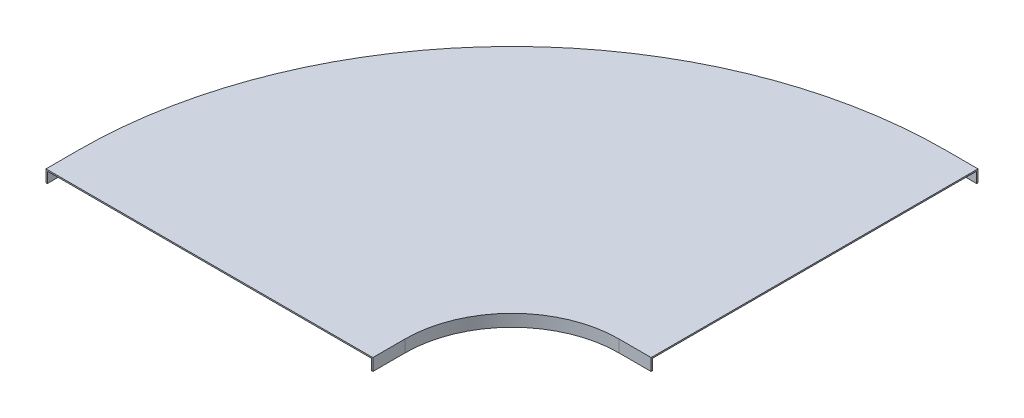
ISO-10303-21;
HEADER;
FILE_DESCRIPTION(('STEP AP214'),'2;1');
FILE_NAME('part.step','',(''),(''),'','','');
FILE_SCHEMA(('AUTOMOTIVE_DESIGN { 1 0 10303 214 1 1 1 1 }'));
ENDSEC;
DATA;
#1=APPLICATION_CONTEXT('core data for automotive mechanical design processes');
#2=APPLICATION_PROTOCOL_DEFINITION('international standard','automotive_design',2000,#1);
#3=PRODUCT_CONTEXT('',#1,'mechanical');
#4=PRODUCT('Part','Part','',(#3));
#5=PRODUCT_RELATED_PRODUCT_CATEGORY('part','',(#4));
#6=PRODUCT_DEFINITION_FORMATION('','',#4);
#7=PRODUCT_DEFINITION_CONTEXT('part definition',#1,'design');
#8=PRODUCT_DEFINITION('design','',#6,#7);
#9=PRODUCT_DEFINITION_SHAPE('','',#8);
#10=(LENGTH_UNIT() NAMED_UNIT(*) SI_UNIT(.MILLI.,.METRE.));
#11=(NAMED_UNIT(*) PLANE_ANGLE_UNIT() SI_UNIT($,.RADIAN.));
#12=(NAMED_UNIT(*) SI_UNIT($,.STERADIAN.) SOLID_ANGLE_UNIT());
#13=UNCERTAINTY_MEASURE_WITH_UNIT(LENGTH_MEASURE(1.E-05),#10,'distance_accuracy_value','');
#14=(GEOMETRIC_REPRESENTATION_CONTEXT(3) GLOBAL_UNCERTAINTY_ASSIGNED_CONTEXT((#13)) GLOBAL_UNIT_ASSIGNED_CONTEXT((#10,
#11,#12)) REPRESENTATION_CONTEXT('',''));
#15=CARTESIAN_POINT('',(0.,0.,0.));
#16=DIRECTION('',(0.,0.,1.));
#17=DIRECTION('',(1.,0.,0.));
#18=AXIS2_PLACEMENT_3D('',#15,#16,#17);
#19=CARTESIAN_POINT('',(100.,0.,-430.));
#20=DIRECTION('',(0.,0.,-1.));
#21=DIRECTION('',(-1.,0.,0.));
#22=AXIS2_PLACEMENT_3D('',#19,#20,#21);
#23=PLANE('',#22);
#24=DIRECTION('',(0.,1.,0.));
#25=VECTOR('',#24,1.);
#26=CARTESIAN_POINT('',(100.,0.,-430.));
#27=LINE('',#26,#25);
#28=CARTESIAN_POINT('',(100.,-10.,-430.));
#29=VERTEX_POINT('',#28);
#30=CARTESIAN_POINT('',(100.,0.,-430.));
#31=VERTEX_POINT('',#30);
#32=EDGE_CURVE('E156',#29,#31,#27,.T.);
#33=ORIENTED_EDGE('',*,*,#32,.F.);
#34=DIRECTION('',(1.,0.,0.));
#35=VECTOR('',#34,1.);
#36=CARTESIAN_POINT('',(100.,-10.,-430.));
#37=LINE('',#36,#35);
#38=CARTESIAN_POINT('',(130.,-10.,-430.));
#39=VERTEX_POINT('',#38);
#40=EDGE_CURVE('E38',#29,#39,#37,.T.);
#41=ORIENTED_EDGE('',*,*,#40,.T.);
#42=DIRECTION('',(0.,1.,0.));
#43=VECTOR('',#42,1.);
#44=CARTESIAN_POINT('',(130.,0.,-430.));
#45=LINE('',#44,#43);
#46=CARTESIAN_POINT('',(130.,0.,-430.));
#47=VERTEX_POINT('',#46);
#48=EDGE_CURVE('E45',#39,#47,#45,.T.);
#49=ORIENTED_EDGE('',*,*,#48,.T.);
#50=DIRECTION('',(1.,0.,0.));
#51=VECTOR('',#50,1.);
#52=CARTESIAN_POINT('',(100.,0.,-430.));
#53=LINE('',#52,#51);
#54=EDGE_CURVE('E11',#31,#47,#53,.T.);
#55=ORIENTED_EDGE('',*,*,#54,.F.);
#56=EDGE_LOOP('',(#33,#41,#49,#55));
#57=FACE_BOUND('',#56,.T.);
#58=ADVANCED_FACE('F31',(#57),#23,.F.);
#59=CARTESIAN_POINT('',(100.,1.21399999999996,-431.214));
#60=DIRECTION('',(0.,0.,1.));
#61=DIRECTION('',(1.,0.,0.));
#62=AXIS2_PLACEMENT_3D('',#59,#60,#61);
#63=PLANE('',#62);
#64=DIRECTION('',(0.,-1.,0.));
#65=VECTOR('',#64,1.);
#66=CARTESIAN_POINT('',(100.,1.21399999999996,-431.214));
#67=LINE('',#66,#65);
#68=CARTESIAN_POINT('',(100.,1.21399999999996,-431.214));
#69=VERTEX_POINT('',#68);
#70=CARTESIAN_POINT('',(100.,-10.,-431.214));
#71=VERTEX_POINT('',#70);
#72=EDGE_CURVE('E187',#69,#71,#67,.T.);
#73=ORIENTED_EDGE('',*,*,#72,.F.);
#74=DIRECTION('',(1.,0.,0.));
#75=VECTOR('',#74,1.);
#76=CARTESIAN_POINT('',(100.,1.21399999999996,-431.214));
#77=LINE('',#76,#75);
#78=CARTESIAN_POINT('',(130.,1.21399999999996,-431.214));
#79=VERTEX_POINT('',#78);
#80=EDGE_CURVE('E235',#69,#79,#77,.T.);
#81=ORIENTED_EDGE('',*,*,#80,.T.);
#82=DIRECTION('',(0.,-1.,0.));
#83=VECTOR('',#82,1.);
#84=CARTESIAN_POINT('',(130.,1.21399999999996,-431.214));
#85=LINE('',#84,#83);
#86=CARTESIAN_POINT('',(130.,-10.,-431.214));
#87=VERTEX_POINT('',#86);
#88=EDGE_CURVE('E221',#79,#87,#85,.T.);
#89=ORIENTED_EDGE('',*,*,#88,.T.);
#90=DIRECTION('',(1.,0.,0.));
#91=VECTOR('',#90,1.);
#92=CARTESIAN_POINT('',(100.,-10.,-431.214));
#93=LINE('',#92,#91);
#94=EDGE_CURVE('E238',#71,#87,#93,.T.);
#95=ORIENTED_EDGE('',*,*,#94,.F.);
#96=EDGE_LOOP('',(#73,#81,#89,#95));
#97=FACE_BOUND('',#96,.T.);
#98=ADVANCED_FACE('F310',(#97),#63,.F.);
#99=CARTESIAN_POINT('',(100.,1.214,-128.786));
#100=DIRECTION('',(0.,0.,-1.));
#101=DIRECTION('',(0.,1.,0.));
#102=AXIS2_PLACEMENT_3D('',#99,#100,#101);
#103=PLANE('',#102);
#104=DIRECTION('',(0.,1.,0.));
#105=VECTOR('',#104,1.);
#106=CARTESIAN_POINT('',(100.,1.214,-128.786));
#107=LINE('',#106,#105);
#108=CARTESIAN_POINT('',(100.,-10.,-128.786));
#109=VERTEX_POINT('',#108);
#110=CARTESIAN_POINT('',(100.,1.214,-128.786));
#111=VERTEX_POINT('',#110);
#112=EDGE_CURVE('E183',#109,#111,#107,.T.);
#113=ORIENTED_EDGE('',*,*,#112,.F.);
#114=DIRECTION('',(1.,0.,0.));
#115=VECTOR('',#114,1.);
#116=CARTESIAN_POINT('',(100.,-10.,-128.786));
#117=LINE('',#116,#115);
#118=CARTESIAN_POINT('',(130.,-10.,-128.786));
#119=VERTEX_POINT('',#118);
#120=EDGE_CURVE('E229',#109,#119,#117,.T.);
#121=ORIENTED_EDGE('',*,*,#120,.T.);
#122=DIRECTION('',(0.,1.,0.));
#123=VECTOR('',#122,1.);
#124=CARTESIAN_POINT('',(130.,1.214,-128.786));
#125=LINE('',#124,#123);
#126=CARTESIAN_POINT('',(130.,1.214,-128.786));
#127=VERTEX_POINT('',#126);
#128=EDGE_CURVE('E217',#119,#127,#125,.T.);
#129=ORIENTED_EDGE('',*,*,#128,.T.);
#130=DIRECTION('',(1.,0.,0.));
#131=VECTOR('',#130,1.);
#132=CARTESIAN_POINT('',(100.,1.214,-128.786));
#133=LINE('',#132,#131);
#134=EDGE_CURVE('E232',#111,#127,#133,.T.);
#135=ORIENTED_EDGE('',*,*,#134,.F.);
#136=EDGE_LOOP('',(#113,#121,#129,#135));
#137=FACE_BOUND('',#136,.T.);
#138=ADVANCED_FACE('F321',(#137),#103,.F.);
#139=CARTESIAN_POINT('',(100.,0.,-130.));
#140=DIRECTION('',(0.,0.,1.));
#141=DIRECTION('',(0.,-1.,0.));
#142=AXIS2_PLACEMENT_3D('',#139,#140,#141);
#143=PLANE('',#142);
#144=DIRECTION('',(0.,-1.,0.));
#145=VECTOR('',#144,1.);
#146=CARTESIAN_POINT('',(100.,0.,-130.));
#147=LINE('',#146,#145);
#148=CARTESIAN_POINT('',(100.,0.,-130.));
#149=VERTEX_POINT('',#148);
#150=CARTESIAN_POINT('',(100.,-10.,-130.));
#151=VERTEX_POINT('',#150);
#152=EDGE_CURVE('E181',#149,#151,#147,.T.);
#153=ORIENTED_EDGE('',*,*,#152,.F.);
#154=DIRECTION('',(1.,0.,0.));
#155=VECTOR('',#154,1.);
#156=CARTESIAN_POINT('',(100.,0.,-130.));
#157=LINE('',#156,#155);
#158=CARTESIAN_POINT('',(130.,0.,-130.));
#159=VERTEX_POINT('',#158);
#160=EDGE_CURVE('E151',#149,#159,#157,.T.);
#161=ORIENTED_EDGE('',*,*,#160,.T.);
#162=DIRECTION('',(0.,-1.,0.));
#163=VECTOR('',#162,1.);
#164=CARTESIAN_POINT('',(130.,0.,-130.));
#165=LINE('',#164,#163);
#166=CARTESIAN_POINT('',(130.,-10.,-130.));
#167=VERTEX_POINT('',#166);
#168=EDGE_CURVE('E213',#159,#167,#165,.T.);
#169=ORIENTED_EDGE('',*,*,#168,.T.);
#170=DIRECTION('',(1.,0.,0.));
#171=VECTOR('',#170,1.);
#172=CARTESIAN_POINT('',(100.,-10.,-130.));
#173=LINE('',#172,#171);
#174=EDGE_CURVE('E226',#151,#167,#173,.T.);
#175=ORIENTED_EDGE('',*,*,#174,.F.);
#176=EDGE_LOOP('',(#153,#161,#169,#175));
#177=FACE_BOUND('',#176,.T.);
#178=ADVANCED_FACE('F319',(#177),#143,.F.);
#179=CARTESIAN_POINT('',(100.,0.,-30.));
#180=DIRECTION('',(0.,-1.,0.));
#181=DIRECTION('',(0.,0.,-1.));
#182=AXIS2_PLACEMENT_3D('',#179,#180,#181);
#183=CYLINDRICAL_SURFACE('',#182,400.);
#184=DIRECTION('',(0.,1.,0.));
#185=VECTOR('',#184,1.);
#186=CARTESIAN_POINT('',(-300.,0.,-30.));
#187=LINE('',#186,#185);
#188=CARTESIAN_POINT('',(-300.,-10.,-30.));
#189=VERTEX_POINT('',#188);
#190=CARTESIAN_POINT('',(-300.,0.,-30.));
#191=VERTEX_POINT('',#190);
#192=EDGE_CURVE('E172',#189,#191,#187,.T.);
#193=ORIENTED_EDGE('',*,*,#192,.F.);
#194=CARTESIAN_POINT('',(100.,-10.,-30.));
#195=DIRECTION('',(0.,-1.,0.));
#196=DIRECTION('',(0.,0.,-1.));
#197=AXIS2_PLACEMENT_3D('',#194,#195,#196);
#198=CIRCLE('',#197,400.);
#199=EDGE_CURVE('E205',#189,#29,#198,.T.);
#200=ORIENTED_EDGE('',*,*,#199,.T.);
#201=ORIENTED_EDGE('',*,*,#32,.T.);
#202=CARTESIAN_POINT('',(100.,0.,-30.));
#203=DIRECTION('',(0.,-1.,0.));
#204=DIRECTION('',(0.,0.,-1.));
#205=AXIS2_PLACEMENT_3D('',#202,#203,#204);
#206=CIRCLE('',#205,400.);
#207=EDGE_CURVE('E208',#191,#31,#206,.T.);
#208=ORIENTED_EDGE('',*,*,#207,.F.);
#209=EDGE_LOOP('',(#193,#200,#201,#208));
#210=FACE_BOUND('',#209,.T.);
#211=ADVANCED_FACE('F247',(#210),#183,.F.);
#212=CARTESIAN_POINT('',(100.,0.,-30.));
#213=DIRECTION('',(0.,-1.,0.));
#214=DIRECTION('',(0.,0.,-1.));
#215=AXIS2_PLACEMENT_3D('',#212,#213,#214);
#216=CYLINDRICAL_SURFACE('',#215,401.214);
#217=DIRECTION('',(0.,-1.,0.));
#218=VECTOR('',#217,1.);
#219=CARTESIAN_POINT('',(-301.214,1.21399999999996,-30.));
#220=LINE('',#219,#218);
#221=CARTESIAN_POINT('',(-301.214,1.21399999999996,-30.));
#222=VERTEX_POINT('',#221);
#223=CARTESIAN_POINT('',(-301.214,-10.,-30.));
#224=VERTEX_POINT('',#223);
#225=EDGE_CURVE('E177',#222,#224,#220,.T.);
#226=ORIENTED_EDGE('',*,*,#225,.F.);
#227=CARTESIAN_POINT('',(100.,1.21399999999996,-30.));
#228=DIRECTION('',(0.,-1.,0.));
#229=DIRECTION('',(0.,0.,-1.));
#230=AXIS2_PLACEMENT_3D('',#227,#228,#229);
#231=CIRCLE('',#230,401.214);
#232=EDGE_CURVE('E199',#222,#69,#231,.T.);
#233=ORIENTED_EDGE('',*,*,#232,.T.);
#234=ORIENTED_EDGE('',*,*,#72,.T.);
#235=CARTESIAN_POINT('',(100.,-10.,-30.));
#236=DIRECTION('',(0.,-1.,0.));
#237=DIRECTION('',(0.,0.,-1.));
#238=AXIS2_PLACEMENT_3D('',#235,#236,#237);
#239=CIRCLE('',#238,401.214);
#240=EDGE_CURVE('E202',#224,#71,#239,.T.);
#241=ORIENTED_EDGE('',*,*,#240,.F.);
#242=EDGE_LOOP('',(#226,#233,#234,#241));
#243=FACE_BOUND('',#242,.T.);
#244=ADVANCED_FACE('F308',(#243),#216,.T.);
#245=CARTESIAN_POINT('',(100.,0.,-30.));
#246=DIRECTION('',(0.,-1.,0.));
#247=DIRECTION('',(0.,0.,-1.));
#248=AXIS2_PLACEMENT_3D('',#245,#246,#247);
#249=CYLINDRICAL_SURFACE('',#248,98.786);
#250=DIRECTION('',(0.,1.,0.));
#251=VECTOR('',#250,1.);
#252=CARTESIAN_POINT('',(1.214,1.214,-30.));
#253=LINE('',#252,#251);
#254=CARTESIAN_POINT('',(1.214,-10.,-30.));
#255=VERTEX_POINT('',#254);
#256=CARTESIAN_POINT('',(1.214,1.214,-30.));
#257=VERTEX_POINT('',#256);
#258=EDGE_CURVE('E164',#255,#257,#253,.T.);
#259=ORIENTED_EDGE('',*,*,#258,.F.);
#260=CARTESIAN_POINT('',(100.,-10.,-30.));
#261=DIRECTION('',(0.,-1.,0.));
#262=DIRECTION('',(0.,0.,-1.));
#263=AXIS2_PLACEMENT_3D('',#260,#261,#262);
#264=CIRCLE('',#263,98.786);
#265=EDGE_CURVE('E193',#255,#109,#264,.T.);
#266=ORIENTED_EDGE('',*,*,#265,.T.);
#267=ORIENTED_EDGE('',*,*,#112,.T.);
#268=CARTESIAN_POINT('',(100.,1.214,-30.));
#269=DIRECTION('',(0.,-1.,0.));
#270=DIRECTION('',(0.,0.,-1.));
#271=AXIS2_PLACEMENT_3D('',#268,#269,#270);
#272=CIRCLE('',#271,98.786);
#273=EDGE_CURVE('E196',#257,#111,#272,.T.);
#274=ORIENTED_EDGE('',*,*,#273,.F.);
#275=EDGE_LOOP('',(#259,#266,#267,#274));
#276=FACE_BOUND('',#275,.T.);
#277=ADVANCED_FACE('F303',(#276),#249,.F.);
#278=CARTESIAN_POINT('',(100.,0.,-30.));
#279=DIRECTION('',(0.,-1.,0.));
#280=DIRECTION('',(0.,0.,-1.));
#281=AXIS2_PLACEMENT_3D('',#278,#279,#280);
#282=CYLINDRICAL_SURFACE('',#281,100.);
#283=DIRECTION('',(0.,-1.,0.));
#284=VECTOR('',#283,1.);
#285=CARTESIAN_POINT('',(0.,0.,-30.));
#286=LINE('',#285,#284);
#287=CARTESIAN_POINT('',(0.,0.,-30.));
#288=VERTEX_POINT('',#287);
#289=CARTESIAN_POINT('',(0.,-10.,-30.));
#290=VERTEX_POINT('',#289);
#291=EDGE_CURVE('E159',#288,#290,#286,.T.);
#292=ORIENTED_EDGE('',*,*,#291,.F.);
#293=CARTESIAN_POINT('',(100.,0.,-30.));
#294=DIRECTION('',(0.,-1.,0.));
#295=DIRECTION('',(0.,0.,-1.));
#296=AXIS2_PLACEMENT_3D('',#293,#294,#295);
#297=CIRCLE('',#296,100.);
#298=EDGE_CURVE('E143',#288,#149,#297,.T.);
#299=ORIENTED_EDGE('',*,*,#298,.T.);
#300=ORIENTED_EDGE('',*,*,#152,.T.);
#301=CARTESIAN_POINT('',(100.,-10.,-30.));
#302=DIRECTION('',(0.,-1.,0.));
#303=DIRECTION('',(0.,0.,-1.));
#304=AXIS2_PLACEMENT_3D('',#301,#302,#303);
#305=CIRCLE('',#304,100.);
#306=EDGE_CURVE('E155',#290,#151,#305,.T.);
#307=ORIENTED_EDGE('',*,*,#306,.F.);
#308=EDGE_LOOP('',(#292,#299,#300,#307));
#309=FACE_BOUND('',#308,.T.);
#310=ADVANCED_FACE('F160',(#309),#282,.T.);
#311=CARTESIAN_POINT('',(0.,0.,-30.));
#312=DIRECTION('',(0.,-1.,0.));
#313=DIRECTION('',(1.,0.,0.));
#314=AXIS2_PLACEMENT_3D('',#311,#312,#313);
#315=PLANE('',#314);
#316=DIRECTION('',(1.,0.,0.));
#317=VECTOR('',#316,1.);
#318=CARTESIAN_POINT('',(0.,0.,0.));
#319=LINE('',#318,#317);
#320=CARTESIAN_POINT('',(-300.,0.,0.));
#321=VERTEX_POINT('',#320);
#322=CARTESIAN_POINT('',(0.,0.,0.));
#323=VERTEX_POINT('',#322);
#324=EDGE_CURVE('E283',#321,#323,#319,.T.);
#325=ORIENTED_EDGE('',*,*,#324,.F.);
#326=DIRECTION('',(0.,0.,1.));
#327=VECTOR('',#326,1.);
#328=CARTESIAN_POINT('',(-300.,0.,-30.));
#329=LINE('',#328,#327);
#330=EDGE_CURVE('E184',#191,#321,#329,.T.);
#331=ORIENTED_EDGE('',*,*,#330,.F.);
#332=ORIENTED_EDGE('',*,*,#207,.T.);
#333=ORIENTED_EDGE('',*,*,#54,.T.);
#334=DIRECTION('',(0.,0.,1.));
#335=VECTOR('',#334,1.);
#336=CARTESIAN_POINT('',(130.,0.,-130.));
#337=LINE('',#336,#335);
#338=EDGE_CURVE('E211',#47,#159,#337,.T.);
#339=ORIENTED_EDGE('',*,*,#338,.T.);
#340=ORIENTED_EDGE('',*,*,#160,.F.);
#341=ORIENTED_EDGE('',*,*,#298,.F.);
#342=DIRECTION('',(0.,0.,1.));
#343=VECTOR('',#342,1.);
#344=CARTESIAN_POINT('',(0.,0.,-30.));
#345=LINE('',#344,#343);
#346=EDGE_CURVE('E148',#288,#323,#345,.T.);
#347=ORIENTED_EDGE('',*,*,#346,.T.);
#348=EDGE_LOOP('',(#325,#331,#332,#333,#339,#340,#341,#347));
#349=FACE_BOUND('',#348,.T.);
#350=ADVANCED_FACE('F146',(#349),#315,.T.);
#351=CARTESIAN_POINT('',(-300.,0.,-30.));
#352=DIRECTION('',(1.,0.,0.));
#353=DIRECTION('',(0.,0.,-1.));
#354=AXIS2_PLACEMENT_3D('',#351,#352,#353);
#355=PLANE('',#354);
#356=DIRECTION('',(0.,1.,0.));
#357=VECTOR('',#356,1.);
#358=CARTESIAN_POINT('',(-300.,0.,0.));
#359=LINE('',#358,#357);
#360=CARTESIAN_POINT('',(-300.,-10.,0.));
#361=VERTEX_POINT('',#360);
#362=EDGE_CURVE('E165',#361,#321,#359,.T.);
#363=ORIENTED_EDGE('',*,*,#362,.F.);
#364=DIRECTION('',(0.,0.,1.));
#365=VECTOR('',#364,1.);
#366=CARTESIAN_POINT('',(-300.,-10.,-30.));
#367=LINE('',#366,#365);
#368=EDGE_CURVE('E244',#189,#361,#367,.T.);
#369=ORIENTED_EDGE('',*,*,#368,.F.);
#370=ORIENTED_EDGE('',*,*,#192,.T.);
#371=ORIENTED_EDGE('',*,*,#330,.T.);
#372=EDGE_LOOP('',(#363,#369,#370,#371));
#373=FACE_BOUND('',#372,.T.);
#374=ADVANCED_FACE('F251',(#373),#355,.T.);
#375=CARTESIAN_POINT('',(-300.,-10.,-30.));
#376=DIRECTION('',(0.,-1.,0.));
#377=DIRECTION('',(0.,0.,-1.));
#378=AXIS2_PLACEMENT_3D('',#375,#376,#377);
#379=PLANE('',#378);
#380=DIRECTION('',(1.,0.,0.));
#381=VECTOR('',#380,1.);
#382=CARTESIAN_POINT('',(-300.,-10.,0.));
#383=LINE('',#382,#381);
#384=CARTESIAN_POINT('',(-301.214,-10.,0.));
#385=VERTEX_POINT('',#384);
#386=EDGE_CURVE('E291',#385,#361,#383,.T.);
#387=ORIENTED_EDGE('',*,*,#386,.F.);
#388=DIRECTION('',(0.,0.,1.));
#389=VECTOR('',#388,1.);
#390=CARTESIAN_POINT('',(-301.214,-10.,-30.));
#391=LINE('',#390,#389);
#392=EDGE_CURVE('E253',#224,#385,#391,.T.);
#393=ORIENTED_EDGE('',*,*,#392,.F.);
#394=ORIENTED_EDGE('',*,*,#240,.T.);
#395=ORIENTED_EDGE('',*,*,#94,.T.);
#396=DIRECTION('',(0.,0.,1.));
#397=VECTOR('',#396,1.);
#398=CARTESIAN_POINT('',(130.,-10.,-430.));
#399=LINE('',#398,#397);
#400=EDGE_CURVE('E53',#87,#39,#399,.T.);
#401=ORIENTED_EDGE('',*,*,#400,.T.);
#402=ORIENTED_EDGE('',*,*,#40,.F.);
#403=ORIENTED_EDGE('',*,*,#199,.F.);
#404=ORIENTED_EDGE('',*,*,#368,.T.);
#405=EDGE_LOOP('',(#387,#393,#394,#395,#401,#402,#403,#404));
#406=FACE_BOUND('',#405,.T.);
#407=ADVANCED_FACE('F241',(#406),#379,.T.);
#408=CARTESIAN_POINT('',(-301.214,1.21399999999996,-30.));
#409=DIRECTION('',(-1.,0.,0.));
#410=DIRECTION('',(0.,0.,1.));
#411=AXIS2_PLACEMENT_3D('',#408,#409,#410);
#412=PLANE('',#411);
#413=DIRECTION('',(0.,-1.,0.));
#414=VECTOR('',#413,1.);
#415=CARTESIAN_POINT('',(-301.214,1.21399999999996,0.));
#416=LINE('',#415,#414);
#417=CARTESIAN_POINT('',(-301.214,1.21399999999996,0.));
#418=VERTEX_POINT('',#417);
#419=EDGE_CURVE('E288',#418,#385,#416,.T.);
#420=ORIENTED_EDGE('',*,*,#419,.F.);
#421=DIRECTION('',(0.,0.,1.));
#422=VECTOR('',#421,1.);
#423=CARTESIAN_POINT('',(-301.214,1.21399999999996,-30.));
#424=LINE('',#423,#422);
#425=EDGE_CURVE('E256',#222,#418,#424,.T.);
#426=ORIENTED_EDGE('',*,*,#425,.F.);
#427=ORIENTED_EDGE('',*,*,#225,.T.);
#428=ORIENTED_EDGE('',*,*,#392,.T.);
#429=EDGE_LOOP('',(#420,#426,#427,#428));
#430=FACE_BOUND('',#429,.T.);
#431=ADVANCED_FACE('F298',(#430),#412,.T.);
#432=CARTESIAN_POINT('',(1.214,1.214,-30.));
#433=DIRECTION('',(0.,1.,0.));
#434=DIRECTION('',(-1.,0.,0.));
#435=AXIS2_PLACEMENT_3D('',#432,#433,#434);
#436=PLANE('',#435);
#437=DIRECTION('',(-1.,0.,0.));
#438=VECTOR('',#437,1.);
#439=CARTESIAN_POINT('',(1.214,1.214,0.));
#440=LINE('',#439,#438);
#441=CARTESIAN_POINT('',(1.214,1.214,0.));
#442=VERTEX_POINT('',#441);
#443=EDGE_CURVE('E279',#442,#418,#440,.T.);
#444=ORIENTED_EDGE('',*,*,#443,.F.);
#445=DIRECTION('',(0.,0.,1.));
#446=VECTOR('',#445,1.);
#447=CARTESIAN_POINT('',(1.214,1.214,-30.));
#448=LINE('',#447,#446);
#449=EDGE_CURVE('E261',#257,#442,#448,.T.);
#450=ORIENTED_EDGE('',*,*,#449,.F.);
#451=ORIENTED_EDGE('',*,*,#273,.T.);
#452=ORIENTED_EDGE('',*,*,#134,.T.);
#453=DIRECTION('',(0.,0.,-1.));
#454=VECTOR('',#453,1.);
#455=CARTESIAN_POINT('',(130.,1.214,-128.786));
#456=LINE('',#455,#454);
#457=EDGE_CURVE('E219',#127,#79,#456,.T.);
#458=ORIENTED_EDGE('',*,*,#457,.T.);
#459=ORIENTED_EDGE('',*,*,#80,.F.);
#460=ORIENTED_EDGE('',*,*,#232,.F.);
#461=ORIENTED_EDGE('',*,*,#425,.T.);
#462=EDGE_LOOP('',(#444,#450,#451,#452,#458,#459,#460,#461));
#463=FACE_BOUND('',#462,.T.);
#464=ADVANCED_FACE('F306',(#463),#436,.T.);
#465=CARTESIAN_POINT('',(1.214,1.214,-30.));
#466=DIRECTION('',(1.,0.,0.));
#467=DIRECTION('',(0.,1.,0.));
#468=AXIS2_PLACEMENT_3D('',#465,#466,#467);
#469=PLANE('',#468);
#470=DIRECTION('',(0.,1.,0.));
#471=VECTOR('',#470,1.);
#472=CARTESIAN_POINT('',(1.214,1.214,0.));
#473=LINE('',#472,#471);
#474=CARTESIAN_POINT('',(1.214,-10.,0.));
#475=VERTEX_POINT('',#474);
#476=EDGE_CURVE('E273',#475,#442,#473,.T.);
#477=ORIENTED_EDGE('',*,*,#476,.F.);
#478=DIRECTION('',(0.,0.,1.));
#479=VECTOR('',#478,1.);
#480=CARTESIAN_POINT('',(1.214,-10.,-30.));
#481=LINE('',#480,#479);
#482=EDGE_CURVE('E174',#255,#475,#481,.T.);
#483=ORIENTED_EDGE('',*,*,#482,.F.);
#484=ORIENTED_EDGE('',*,*,#258,.T.);
#485=ORIENTED_EDGE('',*,*,#449,.T.);
#486=EDGE_LOOP('',(#477,#483,#484,#485));
#487=FACE_BOUND('',#486,.T.);
#488=ADVANCED_FACE('F274',(#487),#469,.T.);
#489=CARTESIAN_POINT('',(0.,-10.,-30.));
#490=DIRECTION('',(0.,-1.,0.));
#491=DIRECTION('',(0.,0.,-1.));
#492=AXIS2_PLACEMENT_3D('',#489,#490,#491);
#493=PLANE('',#492);
#494=DIRECTION('',(1.,0.,0.));
#495=VECTOR('',#494,1.);
#496=CARTESIAN_POINT('',(0.,-10.,0.));
#497=LINE('',#496,#495);
#498=CARTESIAN_POINT('',(0.,-10.,0.));
#499=VERTEX_POINT('',#498);
#500=EDGE_CURVE('E268',#499,#475,#497,.T.);
#501=ORIENTED_EDGE('',*,*,#500,.F.);
#502=DIRECTION('',(0.,0.,1.));
#503=VECTOR('',#502,1.);
#504=CARTESIAN_POINT('',(0.,-10.,-30.));
#505=LINE('',#504,#503);
#506=EDGE_CURVE('E171',#290,#499,#505,.T.);
#507=ORIENTED_EDGE('',*,*,#506,.F.);
#508=ORIENTED_EDGE('',*,*,#306,.T.);
#509=ORIENTED_EDGE('',*,*,#174,.T.);
#510=DIRECTION('',(0.,0.,1.));
#511=VECTOR('',#510,1.);
#512=CARTESIAN_POINT('',(130.,-10.,-130.));
#513=LINE('',#512,#511);
#514=EDGE_CURVE('E215',#167,#119,#513,.T.);
#515=ORIENTED_EDGE('',*,*,#514,.T.);
#516=ORIENTED_EDGE('',*,*,#120,.F.);
#517=ORIENTED_EDGE('',*,*,#265,.F.);
#518=ORIENTED_EDGE('',*,*,#482,.T.);
#519=EDGE_LOOP('',(#501,#507,#508,#509,#515,#516,#517,#518));
#520=FACE_BOUND('',#519,.T.);
#521=ADVANCED_FACE('F266',(#520),#493,.T.);
#522=CARTESIAN_POINT('',(0.,0.,-30.));
#523=DIRECTION('',(-1.,0.,0.));
#524=DIRECTION('',(0.,-1.,0.));
#525=AXIS2_PLACEMENT_3D('',#522,#523,#524);
#526=PLANE('',#525);
#527=DIRECTION('',(0.,-1.,0.));
#528=VECTOR('',#527,1.);
#529=CARTESIAN_POINT('',(0.,0.,0.));
#530=LINE('',#529,#528);
#531=EDGE_CURVE('E169',#323,#499,#530,.T.);
#532=ORIENTED_EDGE('',*,*,#531,.F.);
#533=ORIENTED_EDGE('',*,*,#346,.F.);
#534=ORIENTED_EDGE('',*,*,#291,.T.);
#535=ORIENTED_EDGE('',*,*,#506,.T.);
#536=EDGE_LOOP('',(#532,#533,#534,#535));
#537=FACE_BOUND('',#536,.T.);
#538=ADVANCED_FACE('F167',(#537),#526,.T.);
#539=CARTESIAN_POINT('',(130.,0.,-430.));
#540=DIRECTION('',(-1.,0.,0.));
#541=DIRECTION('',(0.,0.,1.));
#542=AXIS2_PLACEMENT_3D('',#539,#540,#541);
#543=PLANE('',#542);
#544=ORIENTED_EDGE('',*,*,#338,.F.);
#545=ORIENTED_EDGE('',*,*,#48,.F.);
#546=ORIENTED_EDGE('',*,*,#400,.F.);
#547=ORIENTED_EDGE('',*,*,#88,.F.);
#548=ORIENTED_EDGE('',*,*,#457,.F.);
#549=ORIENTED_EDGE('',*,*,#128,.F.);
#550=ORIENTED_EDGE('',*,*,#514,.F.);
#551=ORIENTED_EDGE('',*,*,#168,.F.);
#552=EDGE_LOOP('',(#544,#545,#546,#547,#548,#549,#550,#551));
#553=FACE_BOUND('',#552,.T.);
#554=ADVANCED_FACE('F314',(#553),#543,.F.);
#555=CARTESIAN_POINT('',(-300.,0.,0.));
#556=DIRECTION('',(0.,0.,1.));
#557=DIRECTION('',(1.,0.,0.));
#558=AXIS2_PLACEMENT_3D('',#555,#556,#557);
#559=PLANE('',#558);
#560=ORIENTED_EDGE('',*,*,#324,.T.);
#561=ORIENTED_EDGE('',*,*,#531,.T.);
#562=ORIENTED_EDGE('',*,*,#500,.T.);
#563=ORIENTED_EDGE('',*,*,#476,.T.);
#564=ORIENTED_EDGE('',*,*,#443,.T.);
#565=ORIENTED_EDGE('',*,*,#419,.T.);
#566=ORIENTED_EDGE('',*,*,#386,.T.);
#567=ORIENTED_EDGE('',*,*,#362,.T.);
#568=EDGE_LOOP('',(#560,#561,#562,#563,#564,#565,#566,#567));
#569=FACE_BOUND('',#568,.T.);
#570=ADVANCED_FACE('F281',(#569),#559,.T.);
#571=CLOSED_SHELL('',(#58,#98,#138,#178,#211,#244,#277,#310,#350,#374,#407,#431,#464,#488,#521,
#538,#554,#570));
#572=MANIFOLD_SOLID_BREP('B2',#571);
#573=ADVANCED_BREP_SHAPE_REPRESENTATION('',(#18,#572),#14);
#574=SHAPE_DEFINITION_REPRESENTATION(#9,#573);
ENDSEC;
END-ISO-10303-21;
